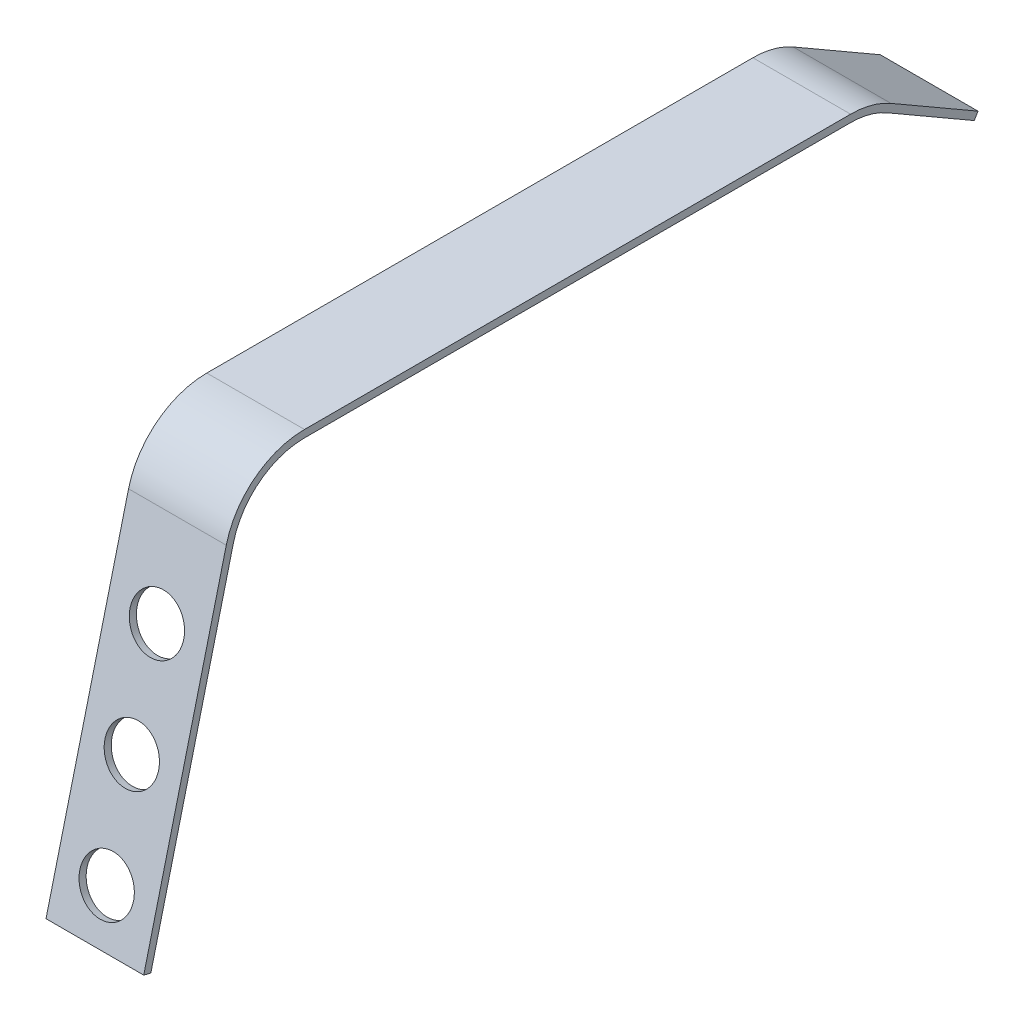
ISO-10303-21;
HEADER;
FILE_DESCRIPTION(('STEP AP214'),'2;1');
FILE_NAME('part.step','',(''),(''),'','','');
FILE_SCHEMA(('AUTOMOTIVE_DESIGN { 1 0 10303 214 1 1 1 1 }'));
ENDSEC;
DATA;
#1=APPLICATION_CONTEXT('core data for automotive mechanical design processes');
#2=APPLICATION_PROTOCOL_DEFINITION('international standard','automotive_design',2000,#1);
#3=PRODUCT_CONTEXT('',#1,'mechanical');
#4=PRODUCT('Part','Part','',(#3));
#5=PRODUCT_RELATED_PRODUCT_CATEGORY('part','',(#4));
#6=PRODUCT_DEFINITION_FORMATION('','',#4);
#7=PRODUCT_DEFINITION_CONTEXT('part definition',#1,'design');
#8=PRODUCT_DEFINITION('design','',#6,#7);
#9=PRODUCT_DEFINITION_SHAPE('','',#8);
#10=(LENGTH_UNIT() NAMED_UNIT(*) SI_UNIT(.MILLI.,.METRE.));
#11=(NAMED_UNIT(*) PLANE_ANGLE_UNIT() SI_UNIT($,.RADIAN.));
#12=(NAMED_UNIT(*) SI_UNIT($,.STERADIAN.) SOLID_ANGLE_UNIT());
#13=UNCERTAINTY_MEASURE_WITH_UNIT(LENGTH_MEASURE(1.E-05),#10,'distance_accuracy_value','');
#14=(GEOMETRIC_REPRESENTATION_CONTEXT(3) GLOBAL_UNCERTAINTY_ASSIGNED_CONTEXT((#13)) GLOBAL_UNIT_ASSIGNED_CONTEXT((#10,
#11,#12)) REPRESENTATION_CONTEXT('',''));
#15=CARTESIAN_POINT('',(0.,0.,0.));
#16=DIRECTION('',(0.,0.,1.));
#17=DIRECTION('',(1.,0.,0.));
#18=AXIS2_PLACEMENT_3D('',#15,#16,#17);
#19=CARTESIAN_POINT('',(4.,-16.1250589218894,29.5268657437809));
#20=DIRECTION('',(0.,0.241921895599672,0.970295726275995));
#21=DIRECTION('',(0.,-0.970295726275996,0.241921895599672));
#22=AXIS2_PLACEMENT_3D('',#19,#20,#21);
#23=PLANE('',#22);
#24=CARTESIAN_POINT('',(2.,-14.1844674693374,29.0430219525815));
#25=DIRECTION('',(0.,0.241921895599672,0.970295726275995));
#26=DIRECTION('',(0.,-0.970295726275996,0.241921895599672));
#27=AXIS2_PLACEMENT_3D('',#24,#25,#26);
#28=CIRCLE('',#27,1.1);
#29=CARTESIAN_POINT('',(2.,-15.2517927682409,29.3091360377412));
#30=VERTEX_POINT('',#29);
#31=EDGE_CURVE('E150',#30,#30,#28,.T.);
#32=ORIENTED_EDGE('',*,*,#31,.T.);
#33=EDGE_LOOP('',(#32));
#34=FACE_BOUND('',#33,.T.);
#35=CARTESIAN_POINT('',(2.,-10.0607106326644,28.0148538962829));
#36=DIRECTION('',(0.,0.241921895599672,0.970295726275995));
#37=DIRECTION('',(0.,-0.970295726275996,0.241921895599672));
#38=AXIS2_PLACEMENT_3D('',#35,#36,#37);
#39=CIRCLE('',#38,1.1);
#40=CARTESIAN_POINT('',(2.,-11.128035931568,28.2809679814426));
#41=VERTEX_POINT('',#40);
#42=EDGE_CURVE('E167',#41,#41,#39,.T.);
#43=ORIENTED_EDGE('',*,*,#42,.T.);
#44=EDGE_LOOP('',(#43));
#45=FACE_BOUND('',#44,.T.);
#46=CARTESIAN_POINT('',(2.,-5.93695379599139,26.9866858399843));
#47=DIRECTION('',(0.,0.241921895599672,0.970295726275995));
#48=DIRECTION('',(0.,-0.970295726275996,0.241921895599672));
#49=AXIS2_PLACEMENT_3D('',#46,#47,#48);
#50=CIRCLE('',#49,1.1);
#51=CARTESIAN_POINT('',(2.,-7.00427909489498,27.252799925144));
#52=VERTEX_POINT('',#51);
#53=EDGE_CURVE('E170',#52,#52,#50,.T.);
#54=ORIENTED_EDGE('',*,*,#53,.T.);
#55=EDGE_LOOP('',(#54));
#56=FACE_BOUND('',#55,.T.);
#57=DIRECTION('',(1.,0.,0.));
#58=VECTOR('',#57,1.);
#59=CARTESIAN_POINT('',(-3.69396885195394,-2.57423431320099,26.1482657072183));
#60=LINE('',#59,#58);
#61=CARTESIAN_POINT('',(0.,-2.57423431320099,26.1482657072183));
#62=VERTEX_POINT('',#61);
#63=CARTESIAN_POINT('',(4.,-2.57423431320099,26.1482657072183));
#64=VERTEX_POINT('',#63);
#65=EDGE_CURVE('E256',#62,#64,#60,.T.);
#66=ORIENTED_EDGE('',*,*,#65,.T.);
#67=DIRECTION('',(0.,0.970295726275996,-0.241921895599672));
#68=VECTOR('',#67,1.);
#69=CARTESIAN_POINT('',(4.,-16.1250589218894,29.5268657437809));
#70=LINE('',#69,#68);
#71=CARTESIAN_POINT('',(4.,-16.1250589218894,29.5268657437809));
#72=VERTEX_POINT('',#71);
#73=EDGE_CURVE('E236',#72,#64,#70,.T.);
#74=ORIENTED_EDGE('',*,*,#73,.F.);
#75=DIRECTION('',(-1.,0.,0.));
#76=VECTOR('',#75,1.);
#77=CARTESIAN_POINT('',(4.,-16.1250589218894,29.5268657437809));
#78=LINE('',#77,#76);
#79=CARTESIAN_POINT('',(0.,-16.1250589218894,29.5268657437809));
#80=VERTEX_POINT('',#79);
#81=EDGE_CURVE('E158',#72,#80,#78,.T.);
#82=ORIENTED_EDGE('',*,*,#81,.T.);
#83=DIRECTION('',(0.,0.970295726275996,-0.241921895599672));
#84=VECTOR('',#83,1.);
#85=CARTESIAN_POINT('',(0.,-16.1250589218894,29.5268657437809));
#86=LINE('',#85,#84);
#87=EDGE_CURVE('E148',#80,#62,#86,.T.);
#88=ORIENTED_EDGE('',*,*,#87,.T.);
#89=EDGE_LOOP('',(#66,#74,#82,#88));
#90=FACE_BOUND('',#89,.T.);
#91=ADVANCED_FACE('F36',(#34,#45,#56,#90),#23,.F.);
#92=CARTESIAN_POINT('',(4.,0.,0.));
#93=DIRECTION('',(0.,-1.,0.));
#94=DIRECTION('',(0.,0.,-1.));
#95=AXIS2_PLACEMENT_3D('',#92,#93,#94);
#96=PLANE('',#95);
#97=DIRECTION('',(0.,0.,1.));
#98=VECTOR('',#97,1.);
#99=CARTESIAN_POINT('',(0.,0.,0.));
#100=LINE('',#99,#98);
#101=CARTESIAN_POINT('',(0.,0.,0.884232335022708));
#102=VERTEX_POINT('',#101);
#103=CARTESIAN_POINT('',(0.,0.,23.2373785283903));
#104=VERTEX_POINT('',#103);
#105=EDGE_CURVE('E146',#102,#104,#100,.T.);
#106=ORIENTED_EDGE('',*,*,#105,.T.);
#107=DIRECTION('',(1.,0.,0.));
#108=VECTOR('',#107,1.);
#109=CARTESIAN_POINT('',(0.,0.,23.2373785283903));
#110=LINE('',#109,#108);
#111=CARTESIAN_POINT('',(4.,0.,23.2373785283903));
#112=VERTEX_POINT('',#111);
#113=EDGE_CURVE('E51',#104,#112,#110,.T.);
#114=ORIENTED_EDGE('',*,*,#113,.T.);
#115=DIRECTION('',(0.,0.,1.));
#116=VECTOR('',#115,1.);
#117=CARTESIAN_POINT('',(4.,0.,0.));
#118=LINE('',#117,#116);
#119=CARTESIAN_POINT('',(4.,0.,0.884232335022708));
#120=VERTEX_POINT('',#119);
#121=EDGE_CURVE('E157',#120,#112,#118,.T.);
#122=ORIENTED_EDGE('',*,*,#121,.F.);
#123=DIRECTION('',(-1.,0.,0.));
#124=VECTOR('',#123,1.);
#125=CARTESIAN_POINT('',(0.,0.,0.884232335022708));
#126=LINE('',#125,#124);
#127=EDGE_CURVE('E182',#120,#102,#126,.T.);
#128=ORIENTED_EDGE('',*,*,#127,.T.);
#129=EDGE_LOOP('',(#106,#114,#122,#128));
#130=FACE_BOUND('',#129,.T.);
#131=ADVANCED_FACE('F208',(#130),#96,.F.);
#132=CARTESIAN_POINT('',(4.,0.539574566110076,25.6810900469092));
#133=DIRECTION('',(0.,-0.241921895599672,-0.970295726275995));
#134=DIRECTION('',(0.,0.970295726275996,-0.241921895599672));
#135=AXIS2_PLACEMENT_3D('',#132,#133,#134);
#136=PLANE('',#135);
#137=CARTESIAN_POINT('',(2.,-5.8643772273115,27.2777745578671));
#138=DIRECTION('',(0.,0.241921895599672,0.970295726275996));
#139=DIRECTION('',(0.,-0.970295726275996,0.241921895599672));
#140=AXIS2_PLACEMENT_3D('',#137,#138,#139);
#141=CIRCLE('',#140,1.1);
#142=CARTESIAN_POINT('',(2.,-6.93170252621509,27.5438886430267));
#143=VERTEX_POINT('',#142);
#144=EDGE_CURVE('E214',#143,#143,#141,.T.);
#145=ORIENTED_EDGE('',*,*,#144,.F.);
#146=EDGE_LOOP('',(#145));
#147=FACE_BOUND('',#146,.T.);
#148=CARTESIAN_POINT('',(2.,-9.98813406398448,28.3059426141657));
#149=DIRECTION('',(0.,0.241921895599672,0.970295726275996));
#150=DIRECTION('',(0.,-0.970295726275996,0.241921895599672));
#151=AXIS2_PLACEMENT_3D('',#148,#149,#150);
#152=CIRCLE('',#151,1.1);
#153=CARTESIAN_POINT('',(2.,-11.0554593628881,28.5720566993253));
#154=VERTEX_POINT('',#153);
#155=EDGE_CURVE('E171',#154,#154,#152,.T.);
#156=ORIENTED_EDGE('',*,*,#155,.F.);
#157=EDGE_LOOP('',(#156));
#158=FACE_BOUND('',#157,.T.);
#159=CARTESIAN_POINT('',(2.,-14.1118909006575,29.3341106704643));
#160=DIRECTION('',(0.,0.241921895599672,0.970295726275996));
#161=DIRECTION('',(0.,-0.970295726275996,0.241921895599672));
#162=AXIS2_PLACEMENT_3D('',#159,#160,#161);
#163=CIRCLE('',#162,1.1);
#164=CARTESIAN_POINT('',(2.,-15.1792161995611,29.6002247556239));
#165=VERTEX_POINT('',#164);
#166=EDGE_CURVE('E166',#165,#165,#163,.T.);
#167=ORIENTED_EDGE('',*,*,#166,.F.);
#168=EDGE_LOOP('',(#167));
#169=FACE_BOUND('',#168,.T.);
#170=DIRECTION('',(0.,-0.970295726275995,0.241921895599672));
#171=VECTOR('',#170,1.);
#172=CARTESIAN_POINT('',(4.,0.539574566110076,25.6810900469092));
#173=LINE('',#172,#171);
#174=CARTESIAN_POINT('',(4.,-2.5016577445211,26.4393544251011));
#175=VERTEX_POINT('',#174);
#176=CARTESIAN_POINT('',(4.,-16.0524823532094,29.8179544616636));
#177=VERTEX_POINT('',#176);
#178=EDGE_CURVE('E139',#175,#177,#173,.T.);
#179=ORIENTED_EDGE('',*,*,#178,.F.);
#180=DIRECTION('',(1.,0.,0.));
#181=VECTOR('',#180,1.);
#182=CARTESIAN_POINT('',(0.,-2.5016577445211,26.4393544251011));
#183=LINE('',#182,#181);
#184=CARTESIAN_POINT('',(0.,-2.5016577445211,26.4393544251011));
#185=VERTEX_POINT('',#184);
#186=EDGE_CURVE('E125',#185,#175,#183,.T.);
#187=ORIENTED_EDGE('',*,*,#186,.F.);
#188=DIRECTION('',(0.,-0.970295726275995,0.241921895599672));
#189=VECTOR('',#188,1.);
#190=CARTESIAN_POINT('',(0.,0.539574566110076,25.6810900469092));
#191=LINE('',#190,#189);
#192=CARTESIAN_POINT('',(0.,-16.0524823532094,29.8179544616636));
#193=VERTEX_POINT('',#192);
#194=EDGE_CURVE('E137',#185,#193,#191,.T.);
#195=ORIENTED_EDGE('',*,*,#194,.T.);
#196=DIRECTION('',(-1.,0.,0.));
#197=VECTOR('',#196,1.);
#198=CARTESIAN_POINT('',(4.,-16.0524823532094,29.8179544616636));
#199=LINE('',#198,#197);
#200=EDGE_CURVE('E161',#177,#193,#199,.T.);
#201=ORIENTED_EDGE('',*,*,#200,.F.);
#202=EDGE_LOOP('',(#179,#187,#195,#201));
#203=FACE_BOUND('',#202,.T.);
#204=ADVANCED_FACE('F135',(#147,#158,#169,#203),#136,.F.);
#205=CARTESIAN_POINT('',(4.,-16.0524823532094,29.8179544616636));
#206=DIRECTION('',(0.,0.970295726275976,-0.241921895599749));
#207=DIRECTION('',(0.,0.241921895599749,0.970295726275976));
#208=AXIS2_PLACEMENT_3D('',#205,#206,#207);
#209=PLANE('',#208);
#210=DIRECTION('',(0.,-0.241921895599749,-0.970295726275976));
#211=VECTOR('',#210,1.);
#212=CARTESIAN_POINT('',(0.,-16.0524823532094,29.8179544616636));
#213=LINE('',#212,#211);
#214=EDGE_CURVE('E145',#193,#80,#213,.T.);
#215=ORIENTED_EDGE('',*,*,#214,.T.);
#216=ORIENTED_EDGE('',*,*,#81,.F.);
#217=DIRECTION('',(0.,-0.241921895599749,-0.970295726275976));
#218=VECTOR('',#217,1.);
#219=CARTESIAN_POINT('',(4.,-16.0524823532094,29.8179544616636));
#220=LINE('',#219,#218);
#221=EDGE_CURVE('E234',#177,#72,#220,.T.);
#222=ORIENTED_EDGE('',*,*,#221,.F.);
#223=ORIENTED_EDGE('',*,*,#200,.T.);
#224=EDGE_LOOP('',(#215,#216,#222,#223));
#225=FACE_BOUND('',#224,.T.);
#226=ADVANCED_FACE('F266',(#225),#209,.F.);
#227=CARTESIAN_POINT('',(4.,-0.3,0.));
#228=DIRECTION('',(0.,1.,0.));
#229=DIRECTION('',(0.,0.,1.));
#230=AXIS2_PLACEMENT_3D('',#227,#228,#229);
#231=PLANE('',#230);
#232=DIRECTION('',(0.,0.,-1.));
#233=VECTOR('',#232,1.);
#234=CARTESIAN_POINT('',(4.,-0.3,0.));
#235=LINE('',#234,#233);
#236=CARTESIAN_POINT('',(4.,-0.300000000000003,23.2373785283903));
#237=VERTEX_POINT('',#236);
#238=CARTESIAN_POINT('',(4.,-0.3,0.884232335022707));
#239=VERTEX_POINT('',#238);
#240=EDGE_CURVE('E59',#237,#239,#235,.T.);
#241=ORIENTED_EDGE('',*,*,#240,.F.);
#242=DIRECTION('',(1.,0.,0.));
#243=VECTOR('',#242,1.);
#244=CARTESIAN_POINT('',(-3.69396885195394,-0.300000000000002,23.2373785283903));
#245=LINE('',#244,#243);
#246=CARTESIAN_POINT('',(0.,-0.300000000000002,23.2373785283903));
#247=VERTEX_POINT('',#246);
#248=EDGE_CURVE('E248',#247,#237,#245,.T.);
#249=ORIENTED_EDGE('',*,*,#248,.F.);
#250=DIRECTION('',(0.,0.,-1.));
#251=VECTOR('',#250,1.);
#252=CARTESIAN_POINT('',(0.,-0.3,0.));
#253=LINE('',#252,#251);
#254=CARTESIAN_POINT('',(0.,-0.3,0.884232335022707));
#255=VERTEX_POINT('',#254);
#256=EDGE_CURVE('E155',#247,#255,#253,.T.);
#257=ORIENTED_EDGE('',*,*,#256,.T.);
#258=DIRECTION('',(1.,0.,0.));
#259=VECTOR('',#258,1.);
#260=CARTESIAN_POINT('',(4.,-0.3,0.884232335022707));
#261=LINE('',#260,#259);
#262=EDGE_CURVE('E163',#255,#239,#261,.T.);
#263=ORIENTED_EDGE('',*,*,#262,.T.);
#264=EDGE_LOOP('',(#241,#249,#257,#263));
#265=FACE_BOUND('',#264,.T.);
#266=ADVANCED_FACE('F247',(#265),#231,.F.);
#267=CARTESIAN_POINT('',(4.,0.299999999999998,21.));
#268=DIRECTION('',(-1.,0.,0.));
#269=DIRECTION('',(0.,0.,1.));
#270=AXIS2_PLACEMENT_3D('',#267,#268,#269);
#271=PLANE('',#270);
#272=ORIENTED_EDGE('',*,*,#121,.T.);
#273=CARTESIAN_POINT('',(4.,-3.3,23.2373785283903));
#274=DIRECTION('',(-1.,0.,0.));
#275=DIRECTION('',(0.,0.,-1.));
#276=AXIS2_PLACEMENT_3D('',#273,#274,#275);
#277=CIRCLE('',#276,3.29999999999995);
#278=EDGE_CURVE('E131',#175,#112,#277,.T.);
#279=ORIENTED_EDGE('',*,*,#278,.F.);
#280=ORIENTED_EDGE('',*,*,#178,.T.);
#281=ORIENTED_EDGE('',*,*,#221,.T.);
#282=ORIENTED_EDGE('',*,*,#73,.T.);
#283=CARTESIAN_POINT('',(4.,-3.3,23.2373785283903));
#284=DIRECTION('',(-1.,0.,0.));
#285=DIRECTION('',(0.,0.,-1.));
#286=AXIS2_PLACEMENT_3D('',#283,#284,#285);
#287=CIRCLE('',#286,3.);
#288=EDGE_CURVE('E140',#64,#237,#287,.T.);
#289=ORIENTED_EDGE('',*,*,#288,.T.);
#290=ORIENTED_EDGE('',*,*,#240,.T.);
#291=CARTESIAN_POINT('',(4.,-3.3,0.884232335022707));
#292=DIRECTION('',(-1.,0.,0.));
#293=DIRECTION('',(0.,0.,1.));
#294=AXIS2_PLACEMENT_3D('',#291,#292,#293);
#295=CIRCLE('',#294,3.);
#296=CARTESIAN_POINT('',(4.,-0.701923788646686,-0.615767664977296));
#297=VERTEX_POINT('',#296);
#298=EDGE_CURVE('E177',#239,#297,#295,.T.);
#299=ORIENTED_EDGE('',*,*,#298,.T.);
#300=DIRECTION('',(0.,-0.500000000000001,-0.866025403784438));
#301=VECTOR('',#300,1.);
#302=CARTESIAN_POINT('',(4.,-0.259807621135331,0.15));
#303=LINE('',#302,#301);
#304=CARTESIAN_POINT('',(4.,-2.75980762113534,-4.18012701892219));
#305=VERTEX_POINT('',#304);
#306=EDGE_CURVE('E253',#297,#305,#303,.T.);
#307=ORIENTED_EDGE('',*,*,#306,.T.);
#308=DIRECTION('',(0.,0.866025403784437,-0.500000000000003));
#309=VECTOR('',#308,1.);
#310=CARTESIAN_POINT('',(4.,-2.50000000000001,-4.33012701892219));
#311=LINE('',#310,#309);
#312=CARTESIAN_POINT('',(4.,-2.50000000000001,-4.33012701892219));
#313=VERTEX_POINT('',#312);
#314=EDGE_CURVE('E203',#305,#313,#311,.T.);
#315=ORIENTED_EDGE('',*,*,#314,.T.);
#316=DIRECTION('',(0.,0.500000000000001,0.866025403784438));
#317=VECTOR('',#316,1.);
#318=CARTESIAN_POINT('',(4.,0.,0.));
#319=LINE('',#318,#317);
#320=CARTESIAN_POINT('',(4.,-0.442116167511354,-0.765767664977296));
#321=VERTEX_POINT('',#320);
#322=EDGE_CURVE('E193',#313,#321,#319,.T.);
#323=ORIENTED_EDGE('',*,*,#322,.T.);
#324=CARTESIAN_POINT('',(4.,-3.3,0.884232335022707));
#325=DIRECTION('',(-1.,0.,0.));
#326=DIRECTION('',(0.,0.,1.));
#327=AXIS2_PLACEMENT_3D('',#324,#325,#326);
#328=CIRCLE('',#327,3.3);
#329=EDGE_CURVE('E11',#321,#120,#328,.F.);
#330=ORIENTED_EDGE('',*,*,#329,.T.);
#331=EDGE_LOOP('',(#272,#279,#280,#281,#282,#289,#290,#299,#307,#315,#323,#330));
#332=FACE_BOUND('',#331,.T.);
#333=ADVANCED_FACE('F200',(#332),#271,.F.);
#334=CARTESIAN_POINT('',(0.,0.299999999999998,21.));
#335=DIRECTION('',(-1.,0.,0.));
#336=DIRECTION('',(0.,0.,1.));
#337=AXIS2_PLACEMENT_3D('',#334,#335,#336);
#338=PLANE('',#337);
#339=CARTESIAN_POINT('',(0.,-3.3,23.2373785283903));
#340=DIRECTION('',(-1.,0.,0.));
#341=DIRECTION('',(0.,0.,-1.));
#342=AXIS2_PLACEMENT_3D('',#339,#340,#341);
#343=CIRCLE('',#342,3.29999999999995);
#344=EDGE_CURVE('E122',#185,#104,#343,.T.);
#345=ORIENTED_EDGE('',*,*,#344,.T.);
#346=ORIENTED_EDGE('',*,*,#105,.F.);
#347=CARTESIAN_POINT('',(0.,-3.3,0.884232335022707));
#348=DIRECTION('',(-1.,0.,0.));
#349=DIRECTION('',(0.,0.,1.));
#350=AXIS2_PLACEMENT_3D('',#347,#348,#349);
#351=CIRCLE('',#350,3.3);
#352=CARTESIAN_POINT('',(0.,-0.442116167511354,-0.765767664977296));
#353=VERTEX_POINT('',#352);
#354=EDGE_CURVE('E185',#102,#353,#351,.T.);
#355=ORIENTED_EDGE('',*,*,#354,.T.);
#356=DIRECTION('',(0.,0.500000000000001,0.866025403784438));
#357=VECTOR('',#356,1.);
#358=CARTESIAN_POINT('',(0.,0.,0.));
#359=LINE('',#358,#357);
#360=CARTESIAN_POINT('',(0.,-2.50000000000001,-4.33012701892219));
#361=VERTEX_POINT('',#360);
#362=EDGE_CURVE('E194',#361,#353,#359,.T.);
#363=ORIENTED_EDGE('',*,*,#362,.F.);
#364=DIRECTION('',(0.,0.866025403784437,-0.500000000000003));
#365=VECTOR('',#364,1.);
#366=CARTESIAN_POINT('',(0.,-2.50000000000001,-4.33012701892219));
#367=LINE('',#366,#365);
#368=CARTESIAN_POINT('',(0.,-2.75980762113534,-4.18012701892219));
#369=VERTEX_POINT('',#368);
#370=EDGE_CURVE('E212',#369,#361,#367,.T.);
#371=ORIENTED_EDGE('',*,*,#370,.F.);
#372=DIRECTION('',(0.,-0.500000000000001,-0.866025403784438));
#373=VECTOR('',#372,1.);
#374=CARTESIAN_POINT('',(0.,-0.259807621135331,0.15));
#375=LINE('',#374,#373);
#376=CARTESIAN_POINT('',(0.,-0.701923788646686,-0.615767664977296));
#377=VERTEX_POINT('',#376);
#378=EDGE_CURVE('E204',#377,#369,#375,.T.);
#379=ORIENTED_EDGE('',*,*,#378,.F.);
#380=CARTESIAN_POINT('',(0.,-3.3,0.884232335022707));
#381=DIRECTION('',(-1.,0.,0.));
#382=DIRECTION('',(0.,0.,1.));
#383=AXIS2_PLACEMENT_3D('',#380,#381,#382);
#384=CIRCLE('',#383,3.);
#385=EDGE_CURVE('E179',#377,#255,#384,.F.);
#386=ORIENTED_EDGE('',*,*,#385,.T.);
#387=ORIENTED_EDGE('',*,*,#256,.F.);
#388=CARTESIAN_POINT('',(0.,-3.3,23.2373785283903));
#389=DIRECTION('',(-1.,0.,0.));
#390=DIRECTION('',(0.,0.,1.));
#391=AXIS2_PLACEMENT_3D('',#388,#389,#390);
#392=CIRCLE('',#391,3.);
#393=EDGE_CURVE('E258',#62,#247,#392,.T.);
#394=ORIENTED_EDGE('',*,*,#393,.F.);
#395=ORIENTED_EDGE('',*,*,#87,.F.);
#396=ORIENTED_EDGE('',*,*,#214,.F.);
#397=ORIENTED_EDGE('',*,*,#194,.F.);
#398=EDGE_LOOP('',(#345,#346,#355,#363,#371,#379,#386,#387,#394,#395,#396,#397));
#399=FACE_BOUND('',#398,.T.);
#400=ADVANCED_FACE('F143',(#399),#338,.T.);
#401=CARTESIAN_POINT('',(2.,-21.1154793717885,1.24425156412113));
#402=DIRECTION('',(0.,0.241921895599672,0.970295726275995));
#403=DIRECTION('',(0.,-0.970295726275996,0.241921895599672));
#404=AXIS2_PLACEMENT_3D('',#401,#402,#403);
#405=CYLINDRICAL_SURFACE('',#404,1.1);
#406=ORIENTED_EDGE('',*,*,#166,.T.);
#407=EDGE_LOOP('',(#406));
#408=FACE_BOUND('',#407,.T.);
#409=ORIENTED_EDGE('',*,*,#31,.F.);
#410=EDGE_LOOP('',(#409));
#411=FACE_BOUND('',#410,.T.);
#412=ADVANCED_FACE('F314',(#408,#411),#405,.F.);
#413=CARTESIAN_POINT('',(2.,-16.9917225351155,0.216083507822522));
#414=DIRECTION('',(0.,0.241921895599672,0.970295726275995));
#415=DIRECTION('',(0.,-0.970295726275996,0.241921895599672));
#416=AXIS2_PLACEMENT_3D('',#413,#414,#415);
#417=CYLINDRICAL_SURFACE('',#416,1.1);
#418=ORIENTED_EDGE('',*,*,#155,.T.);
#419=EDGE_LOOP('',(#418));
#420=FACE_BOUND('',#419,.T.);
#421=ORIENTED_EDGE('',*,*,#42,.F.);
#422=EDGE_LOOP('',(#421));
#423=FACE_BOUND('',#422,.T.);
#424=ADVANCED_FACE('F310',(#420,#423),#417,.F.);
#425=CARTESIAN_POINT('',(2.,-12.8679656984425,-0.812084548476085));
#426=DIRECTION('',(0.,0.241921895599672,0.970295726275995));
#427=DIRECTION('',(0.,-0.970295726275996,0.241921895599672));
#428=AXIS2_PLACEMENT_3D('',#425,#426,#427);
#429=CYLINDRICAL_SURFACE('',#428,1.1);
#430=ORIENTED_EDGE('',*,*,#144,.T.);
#431=EDGE_LOOP('',(#430));
#432=FACE_BOUND('',#431,.T.);
#433=ORIENTED_EDGE('',*,*,#53,.F.);
#434=EDGE_LOOP('',(#433));
#435=FACE_BOUND('',#434,.T.);
#436=ADVANCED_FACE('F307',(#432,#435),#429,.F.);
#437=CARTESIAN_POINT('',(-5.26194604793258,-0.259807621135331,0.15));
#438=DIRECTION('',(0.,-0.866025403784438,0.500000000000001));
#439=DIRECTION('',(0.,-0.500000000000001,-0.866025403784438));
#440=AXIS2_PLACEMENT_3D('',#437,#438,#439);
#441=PLANE('',#440);
#442=ORIENTED_EDGE('',*,*,#306,.F.);
#443=DIRECTION('',(1.,0.,0.));
#444=VECTOR('',#443,1.);
#445=CARTESIAN_POINT('',(-5.26194604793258,-0.701923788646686,-0.615767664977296));
#446=LINE('',#445,#444);
#447=EDGE_CURVE('E175',#297,#377,#446,.F.);
#448=ORIENTED_EDGE('',*,*,#447,.T.);
#449=ORIENTED_EDGE('',*,*,#378,.T.);
#450=DIRECTION('',(1.,0.,0.));
#451=VECTOR('',#450,1.);
#452=CARTESIAN_POINT('',(-5.26194604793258,-2.75980762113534,-4.18012701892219));
#453=LINE('',#452,#451);
#454=EDGE_CURVE('E221',#369,#305,#453,.T.);
#455=ORIENTED_EDGE('',*,*,#454,.T.);
#456=EDGE_LOOP('',(#442,#448,#449,#455));
#457=FACE_BOUND('',#456,.T.);
#458=ADVANCED_FACE('F302',(#457),#441,.T.);
#459=CARTESIAN_POINT('',(-5.26194604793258,-2.50000000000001,-4.33012701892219));
#460=DIRECTION('',(0.,-0.500000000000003,-0.866025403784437));
#461=DIRECTION('',(0.,0.866025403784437,-0.500000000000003));
#462=AXIS2_PLACEMENT_3D('',#459,#460,#461);
#463=PLANE('',#462);
#464=ORIENTED_EDGE('',*,*,#454,.F.);
#465=ORIENTED_EDGE('',*,*,#370,.T.);
#466=DIRECTION('',(1.,0.,0.));
#467=VECTOR('',#466,1.);
#468=CARTESIAN_POINT('',(-5.26194604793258,-2.50000000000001,-4.33012701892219));
#469=LINE('',#468,#467);
#470=EDGE_CURVE('E215',#361,#313,#469,.T.);
#471=ORIENTED_EDGE('',*,*,#470,.T.);
#472=ORIENTED_EDGE('',*,*,#314,.F.);
#473=EDGE_LOOP('',(#464,#465,#471,#472));
#474=FACE_BOUND('',#473,.T.);
#475=ADVANCED_FACE('F219',(#474),#463,.T.);
#476=CARTESIAN_POINT('',(-5.26194604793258,0.,0.));
#477=DIRECTION('',(0.,0.866025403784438,-0.500000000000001));
#478=DIRECTION('',(0.,0.500000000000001,0.866025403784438));
#479=AXIS2_PLACEMENT_3D('',#476,#477,#478);
#480=PLANE('',#479);
#481=ORIENTED_EDGE('',*,*,#362,.T.);
#482=DIRECTION('',(-1.,0.,0.));
#483=VECTOR('',#482,1.);
#484=CARTESIAN_POINT('',(4.,-0.442116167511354,-0.765767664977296));
#485=LINE('',#484,#483);
#486=EDGE_CURVE('E44',#353,#321,#485,.F.);
#487=ORIENTED_EDGE('',*,*,#486,.T.);
#488=ORIENTED_EDGE('',*,*,#322,.F.);
#489=ORIENTED_EDGE('',*,*,#470,.F.);
#490=EDGE_LOOP('',(#481,#487,#488,#489));
#491=FACE_BOUND('',#490,.T.);
#492=ADVANCED_FACE('F191',(#491),#480,.T.);
#493=CARTESIAN_POINT('',(4.,-3.3,0.884232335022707));
#494=DIRECTION('',(1.,0.,0.));
#495=DIRECTION('',(0.,0.,-1.));
#496=AXIS2_PLACEMENT_3D('',#493,#494,#495);
#497=CYLINDRICAL_SURFACE('',#496,3.);
#498=ORIENTED_EDGE('',*,*,#385,.F.);
#499=ORIENTED_EDGE('',*,*,#447,.F.);
#500=ORIENTED_EDGE('',*,*,#298,.F.);
#501=ORIENTED_EDGE('',*,*,#262,.F.);
#502=EDGE_LOOP('',(#498,#499,#500,#501));
#503=FACE_BOUND('',#502,.T.);
#504=ADVANCED_FACE('F246',(#503),#497,.F.);
#505=CARTESIAN_POINT('',(4.,-3.3,0.884232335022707));
#506=DIRECTION('',(1.,0.,0.));
#507=DIRECTION('',(0.,0.,-1.));
#508=AXIS2_PLACEMENT_3D('',#505,#506,#507);
#509=CYLINDRICAL_SURFACE('',#508,3.3);
#510=ORIENTED_EDGE('',*,*,#329,.F.);
#511=ORIENTED_EDGE('',*,*,#486,.F.);
#512=ORIENTED_EDGE('',*,*,#354,.F.);
#513=ORIENTED_EDGE('',*,*,#127,.F.);
#514=EDGE_LOOP('',(#510,#511,#512,#513));
#515=FACE_BOUND('',#514,.T.);
#516=ADVANCED_FACE('F38',(#515),#509,.T.);
#517=CARTESIAN_POINT('',(-3.69396885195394,-3.3,23.2373785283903));
#518=DIRECTION('',(1.,0.,0.));
#519=DIRECTION('',(0.,0.,-1.));
#520=AXIS2_PLACEMENT_3D('',#517,#518,#519);
#521=CYLINDRICAL_SURFACE('',#520,3.);
#522=ORIENTED_EDGE('',*,*,#65,.F.);
#523=ORIENTED_EDGE('',*,*,#393,.T.);
#524=ORIENTED_EDGE('',*,*,#248,.T.);
#525=ORIENTED_EDGE('',*,*,#288,.F.);
#526=EDGE_LOOP('',(#522,#523,#524,#525));
#527=FACE_BOUND('',#526,.T.);
#528=ADVANCED_FACE('F271',(#527),#521,.F.);
#529=CARTESIAN_POINT('',(0.,-3.3,23.2373785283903));
#530=DIRECTION('',(1.,0.,0.));
#531=DIRECTION('',(0.,0.,-1.));
#532=AXIS2_PLACEMENT_3D('',#529,#530,#531);
#533=CYLINDRICAL_SURFACE('',#532,3.29999999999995);
#534=ORIENTED_EDGE('',*,*,#278,.T.);
#535=ORIENTED_EDGE('',*,*,#113,.F.);
#536=ORIENTED_EDGE('',*,*,#344,.F.);
#537=ORIENTED_EDGE('',*,*,#186,.T.);
#538=EDGE_LOOP('',(#534,#535,#536,#537));
#539=FACE_BOUND('',#538,.T.);
#540=ADVANCED_FACE('F124',(#539),#533,.T.);
#541=CLOSED_SHELL('',(#91,#131,#204,#226,#266,#333,#400,#412,#424,#436,#458,#475,#492,#504,#516,
#528,#540));
#542=MANIFOLD_SOLID_BREP('B2',#541);
#543=ADVANCED_BREP_SHAPE_REPRESENTATION('',(#18,#542),#14);
#544=SHAPE_DEFINITION_REPRESENTATION(#9,#543);
ENDSEC;
END-ISO-10303-21;
